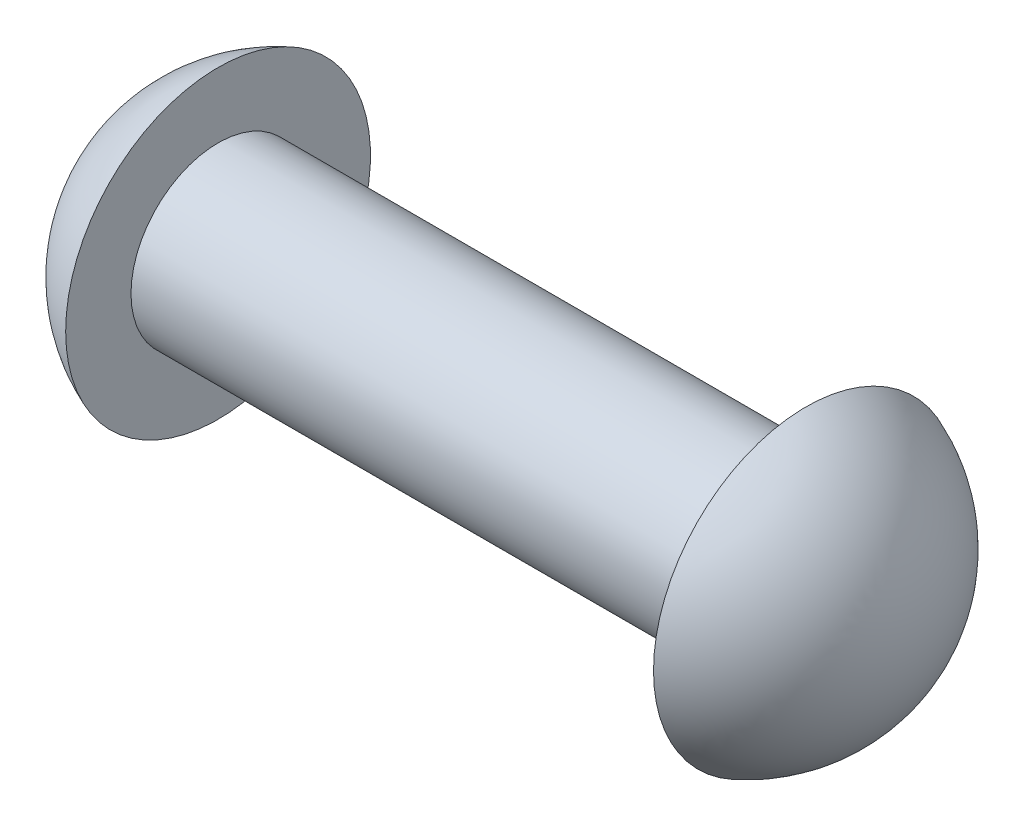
from build123d import *


with BuildPart() as part:
    # Sketch1 → Base-Revolve (revolve)
    with BuildSketch(Plane.XY, mode=Mode.PRIVATE) as base_revolve_sk:
        with BuildLine():
            Line((-31.8, 0), (0, 0))
            Line((0, 0), (0, 4))
            Line((0, 4), (-27, 4))
            Line((-27, 4), (-27, 7))
            ThreePointArc((-27, 7), (-30.485466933, 4.244320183), (-31.8, 0))
        make_face()
    revolve(base_revolve_sk.sketch.rotate(Axis((-39, 0, 0), (1, 0, 0)), 90), axis=Axis((-39, 0, 0), (1, 0, 0)))

    # Sketch3 → HeadTypeA (revolve)
    with BuildSketch(Plane.XY):
        with BuildLine():
            Line((0, 0), (4.8, 0))
            ThreePointArc((4.8, 0), (3.485466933, 4.244320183), (0, 7))
            Line((0, 7), (0, 0))
        make_face()
    revolve(axis=Axis((-49, 0, 0), (1, 0, 0)))


solid = part.part
